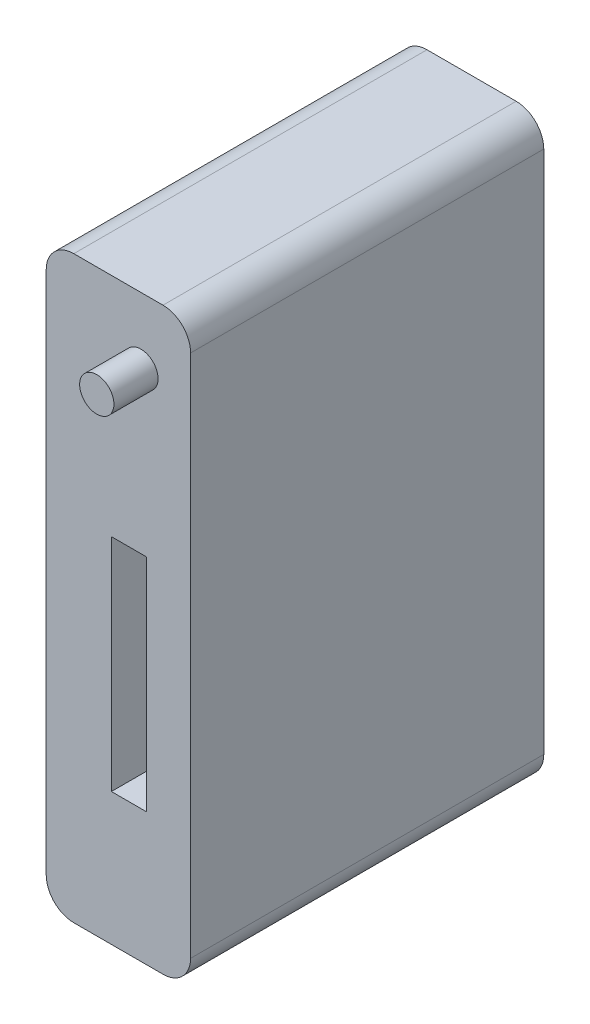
from build123d import *

# Parameters (mm, degrees)
BOSS_EXTRUDE1_DEPTH = 32
SKETCH2_W           = 6.35
SKETCH2_H           = 40
CUT_EXTRUDE1_DEPTH  = 7.62
SKETCH3_R           = 3.105
BOSS_EXTRUDE2_DEPTH = 8


with BuildPart() as part:
    # Sketch1 → Boss-Extrude1 (new, symmetric)
    with BuildSketch(Plane.XY):
        with BuildLine():
            Line((-8.081, -52.5), (8.081, -52.5))
            ThreePointArc((8.081, -52.5), (11.616533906, -51.035533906), (13.081, -47.5))
            Line((13.081, -47.5), (13.081, 47.5))
            ThreePointArc((13.081, 47.5), (11.616533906, 51.035533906), (8.081, 52.5))
            Line((8.081, 52.5), (-8.081, 52.5))
            ThreePointArc((-8.081, 52.5), (-11.616533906, 51.035533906), (-13.081, 47.5))
            Line((-13.081, 47.5), (-13.081, -47.5))
            ThreePointArc((-13.081, -47.5), (-11.616533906, -51.035533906), (-8.081, -52.5))
        make_face()
    extrude(amount=BOSS_EXTRUDE1_DEPTH, both=True)

    # Sketch2 → Cut-Extrude1 (cut)
    with BuildSketch(Plane.XY.offset(32)):
        with Locations((1.906, -8.5)):
            Rectangle(SKETCH2_W, SKETCH2_H)
    extrude(amount=-CUT_EXTRUDE1_DEPTH, mode=Mode.SUBTRACT)

    # Sketch3 → Boss-Extrude2 (add)
    with BuildSketch(Plane.XY.offset(32)):
        with Locations(Location((4.081, 40.5, 0), (0, 0, 180))):
            Circle(SKETCH3_R)
    extrude(amount=BOSS_EXTRUDE2_DEPTH)


solid = part.part
